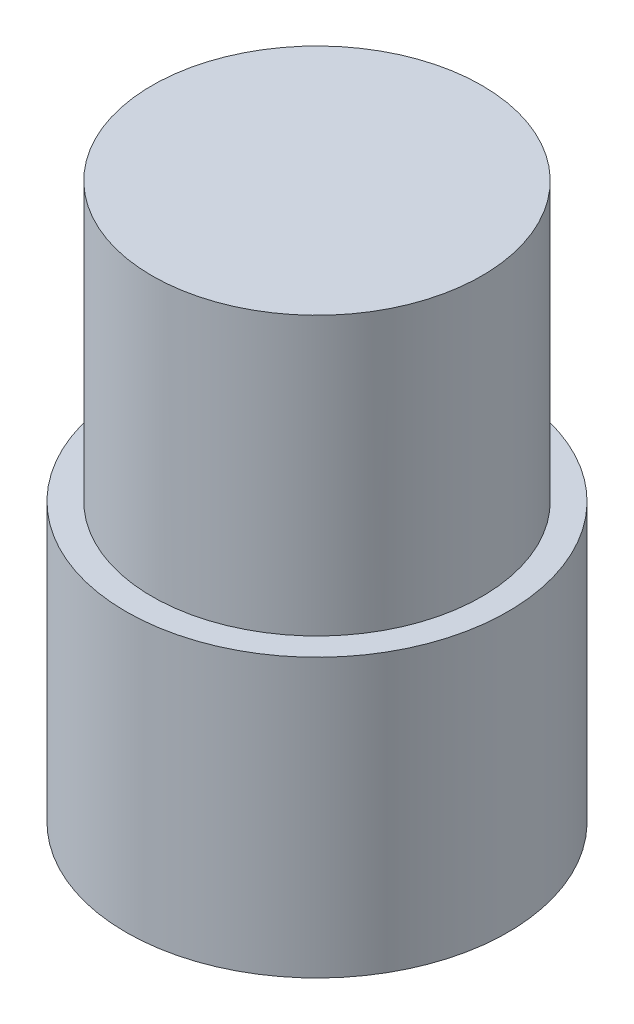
from build123d import *

# Parameters (mm, degrees)
SKETCH1_R           = 1.2065
BOSS_EXTRUDE1_DEPTH = 2.032
SKETCH2_R           = 1.397
BOSS_EXTRUDE2_DEPTH = 2.032


with BuildPart() as part:
    # Sketch1 → Boss-Extrude1 (new body)
    with BuildSketch(Plane(origin=(0, 0, 0), x_dir=(1, 0, 0), z_dir=(0, 1, 0))):
        with Locations(Location((0, 0, 0), (0, 0, 270))):
            Circle(SKETCH1_R)
    extrude(amount=BOSS_EXTRUDE1_DEPTH)

    # Sketch2 → Boss-Extrude2 (add)
    with BuildSketch(Plane.XZ):
        with Locations(Location((0, 0, 0), (0, 0, 270))):
            Circle(SKETCH2_R)
    extrude(amount=BOSS_EXTRUDE2_DEPTH)


solid = part.part
